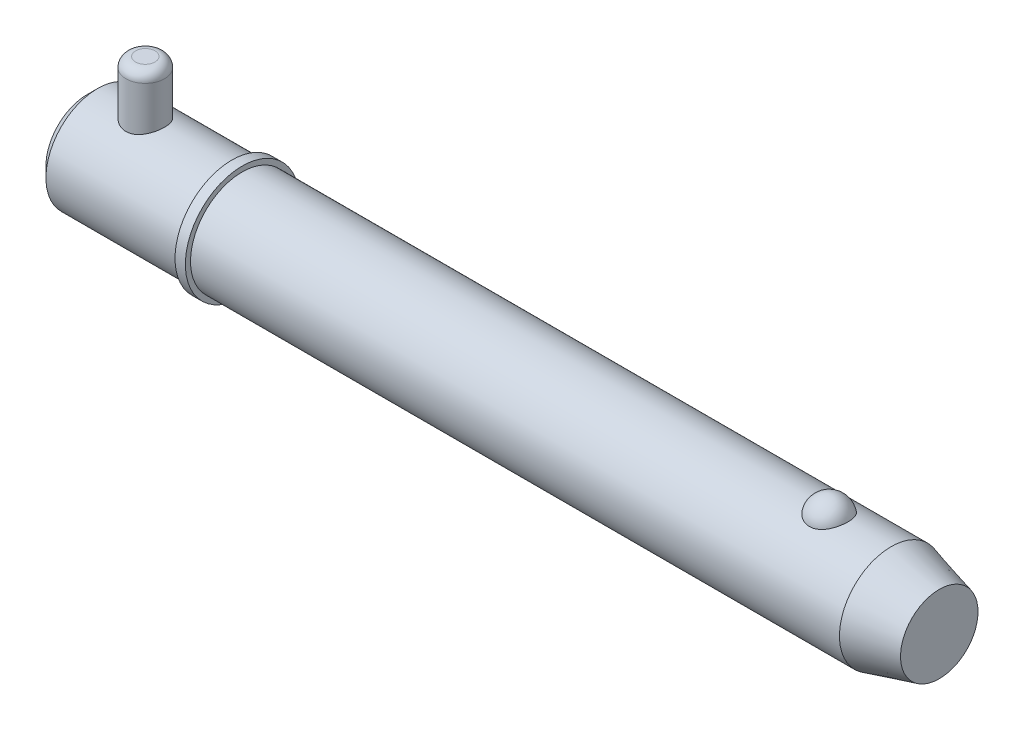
ISO-10303-21;
HEADER;
FILE_DESCRIPTION(('STEP AP214'),'2;1');
FILE_NAME('part.step','',(''),(''),'','','');
FILE_SCHEMA(('AUTOMOTIVE_DESIGN { 1 0 10303 214 1 1 1 1 }'));
ENDSEC;
DATA;
#1=APPLICATION_CONTEXT('core data for automotive mechanical design processes');
#2=APPLICATION_PROTOCOL_DEFINITION('international standard','automotive_design',2000,#1);
#3=PRODUCT_CONTEXT('',#1,'mechanical');
#4=PRODUCT('Part','Part','',(#3));
#5=PRODUCT_RELATED_PRODUCT_CATEGORY('part','',(#4));
#6=PRODUCT_DEFINITION_FORMATION('','',#4);
#7=PRODUCT_DEFINITION_CONTEXT('part definition',#1,'design');
#8=PRODUCT_DEFINITION('design','',#6,#7);
#9=PRODUCT_DEFINITION_SHAPE('','',#8);
#10=(LENGTH_UNIT() NAMED_UNIT(*) SI_UNIT(.MILLI.,.METRE.));
#11=(NAMED_UNIT(*) PLANE_ANGLE_UNIT() SI_UNIT($,.RADIAN.));
#12=(NAMED_UNIT(*) SI_UNIT($,.STERADIAN.) SOLID_ANGLE_UNIT());
#13=UNCERTAINTY_MEASURE_WITH_UNIT(LENGTH_MEASURE(1.E-05),#10,'distance_accuracy_value','');
#14=(GEOMETRIC_REPRESENTATION_CONTEXT(3) GLOBAL_UNCERTAINTY_ASSIGNED_CONTEXT((#13)) GLOBAL_UNIT_ASSIGNED_CONTEXT((#10,
#11,#12)) REPRESENTATION_CONTEXT('',''));
#15=CARTESIAN_POINT('',(0.,0.,0.));
#16=DIRECTION('',(0.,0.,1.));
#17=DIRECTION('',(1.,0.,0.));
#18=AXIS2_PLACEMENT_3D('',#15,#16,#17);
#19=CARTESIAN_POINT('',(14.28,25.4,0.));
#20=DIRECTION('',(0.,-1.,0.));
#21=DIRECTION('',(0.,0.,-1.));
#22=AXIS2_PLACEMENT_3D('',#19,#20,#21);
#23=CYLINDRICAL_SURFACE('',#22,4.76);
#24=CARTESIAN_POINT('',(14.28,-10.32,0.));
#25=DIRECTION('',(0.,1.,0.));
#26=DIRECTION('',(0.,0.,1.));
#27=AXIS2_PLACEMENT_3D('',#24,#25,#26);
#28=CIRCLE('',#27,4.76);
#29=CARTESIAN_POINT('',(14.28,-10.32,-4.76));
#30=VERTEX_POINT('',#29);
#31=EDGE_CURVE('P0_E25',#30,#30,#28,.T.);
#32=CARTESIAN_POINT('',(14.28,23.02,0.));
#33=DIRECTION('',(0.,1.,0.));
#34=DIRECTION('',(0.,0.,1.));
#35=AXIS2_PLACEMENT_3D('',#32,#33,#34);
#36=CIRCLE('',#35,4.76);
#37=CARTESIAN_POINT('',(14.28,23.02,-4.76));
#38=VERTEX_POINT('',#37);
#39=EDGE_CURVE('P0_E29',#38,#38,#36,.F.);
#40=CARTESIAN_POINT('',(14.28,-10.32,-4.76));
#41=CARTESIAN_POINT('',(14.28,-9.97270833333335,-4.76));
#42=CARTESIAN_POINT('',(14.28,-9.62541666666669,-4.76));
#43=CARTESIAN_POINT('',(14.28,-8.93083333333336,-4.76));
#44=CARTESIAN_POINT('',(14.28,-8.58354166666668,-4.76));
#45=CARTESIAN_POINT('',(14.28,-7.88895833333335,-4.76));
#46=CARTESIAN_POINT('',(14.28,-7.54166666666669,-4.76));
#47=CARTESIAN_POINT('',(14.28,-6.84708333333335,-4.76));
#48=CARTESIAN_POINT('',(14.28,-6.49979166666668,-4.76));
#49=CARTESIAN_POINT('',(14.28,-5.80520833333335,-4.76));
#50=CARTESIAN_POINT('',(14.28,-5.45791666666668,-4.76));
#51=CARTESIAN_POINT('',(14.28,-4.76333333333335,-4.76));
#52=CARTESIAN_POINT('',(14.28,-4.41604166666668,-4.76));
#53=CARTESIAN_POINT('',(14.28,-3.72145833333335,-4.76));
#54=CARTESIAN_POINT('',(14.28,-3.37416666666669,-4.76));
#55=CARTESIAN_POINT('',(14.28,-2.67958333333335,-4.76));
#56=CARTESIAN_POINT('',(14.28,-2.33229166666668,-4.76));
#57=CARTESIAN_POINT('',(14.28,-1.63770833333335,-4.76));
#58=CARTESIAN_POINT('',(14.28,-1.29041666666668,-4.76));
#59=CARTESIAN_POINT('',(14.28,-0.595833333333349,-4.76));
#60=CARTESIAN_POINT('',(14.28,-0.24854166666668,-4.76));
#61=CARTESIAN_POINT('',(14.28,0.446041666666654,-4.76));
#62=CARTESIAN_POINT('',(14.28,0.793333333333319,-4.76));
#63=CARTESIAN_POINT('',(14.28,1.48791666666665,-4.76));
#64=CARTESIAN_POINT('',(14.28,1.83520833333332,-4.76));
#65=CARTESIAN_POINT('',(14.28,2.52979166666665,-4.76));
#66=CARTESIAN_POINT('',(14.28,2.87708333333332,-4.76));
#67=CARTESIAN_POINT('',(14.28,3.57166666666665,-4.76));
#68=CARTESIAN_POINT('',(14.28,3.91895833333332,-4.76));
#69=CARTESIAN_POINT('',(14.28,4.61354166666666,-4.76));
#70=CARTESIAN_POINT('',(14.28,4.96083333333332,-4.76));
#71=CARTESIAN_POINT('',(14.28,5.65541666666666,-4.76));
#72=CARTESIAN_POINT('',(14.28,6.00270833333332,-4.76));
#73=CARTESIAN_POINT('',(14.28,6.69729166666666,-4.76));
#74=CARTESIAN_POINT('',(14.28,7.04458333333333,-4.76));
#75=CARTESIAN_POINT('',(14.28,7.73916666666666,-4.76));
#76=CARTESIAN_POINT('',(14.28,8.08645833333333,-4.76));
#77=CARTESIAN_POINT('',(14.28,8.78104166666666,-4.76));
#78=CARTESIAN_POINT('',(14.28,9.12833333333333,-4.76));
#79=CARTESIAN_POINT('',(14.28,9.82291666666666,-4.76));
#80=CARTESIAN_POINT('',(14.28,10.1702083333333,-4.76));
#81=CARTESIAN_POINT('',(14.28,10.8647916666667,-4.76));
#82=CARTESIAN_POINT('',(14.28,11.2120833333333,-4.76));
#83=CARTESIAN_POINT('',(14.28,11.9066666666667,-4.76));
#84=CARTESIAN_POINT('',(14.28,12.2539583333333,-4.76));
#85=CARTESIAN_POINT('',(14.28,12.9485416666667,-4.76));
#86=CARTESIAN_POINT('',(14.28,13.2958333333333,-4.76));
#87=CARTESIAN_POINT('',(14.28,13.9904166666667,-4.76));
#88=CARTESIAN_POINT('',(14.28,14.3377083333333,-4.76));
#89=CARTESIAN_POINT('',(14.28,15.0322916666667,-4.76));
#90=CARTESIAN_POINT('',(14.28,15.3795833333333,-4.76));
#91=CARTESIAN_POINT('',(14.28,16.0741666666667,-4.76));
#92=CARTESIAN_POINT('',(14.28,16.4214583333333,-4.76));
#93=CARTESIAN_POINT('',(14.28,17.1160416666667,-4.76));
#94=CARTESIAN_POINT('',(14.28,17.4633333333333,-4.76));
#95=CARTESIAN_POINT('',(14.28,18.1579166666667,-4.76));
#96=CARTESIAN_POINT('',(14.28,18.5052083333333,-4.76));
#97=CARTESIAN_POINT('',(14.28,19.1997916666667,-4.76));
#98=CARTESIAN_POINT('',(14.28,19.5470833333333,-4.76));
#99=CARTESIAN_POINT('',(14.28,20.2416666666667,-4.76));
#100=CARTESIAN_POINT('',(14.28,20.5889583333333,-4.76));
#101=CARTESIAN_POINT('',(14.28,21.2835416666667,-4.76));
#102=CARTESIAN_POINT('',(14.28,21.6308333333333,-4.76));
#103=CARTESIAN_POINT('',(14.28,22.3254166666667,-4.76));
#104=CARTESIAN_POINT('',(14.28,22.6727083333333,-4.76));
#105=CARTESIAN_POINT('',(14.28,23.02,-4.76));
#106=B_SPLINE_CURVE_WITH_KNOTS('',3,(#40,#41,#42,#43,#44,#45,#46,#47,#48,#49,#50,#51,#52,#53,
#54,#55,#56,#57,#58,#59,#60,#61,#62,#63,#64,#65,#66,#67,#68,#69,#70,#71,#72,#73,#74,#75,#76,#77,
#78,#79,#80,#81,#82,#83,#84,#85,#86,#87,#88,#89,#90,#91,#92,#93,#94,#95,#96,#97,#98,#99,#100,
#101,#102,#103,#104,#105),.UNSPECIFIED.,.F.,.F.,(4,2,2,2,2,2,2,2,2,2,2,2,2,2,2,2,2,2,2,2,2,2,2,
2,2,2,2,2,2,2,2,2,4),(0.,1.041875,2.08375,3.125625,4.1675,5.209375,6.25125,7.293125,
8.33500000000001,9.376875,10.41875,11.460625,12.5025,13.544375,14.58625,15.628125,16.67,
17.711875,18.75375,19.795625,20.8375,21.879375,22.92125,23.963125,25.005,26.046875,27.08875,
28.130625,29.1725,30.214375,31.25625,32.298125,33.34),.UNSPECIFIED.);
#107=EDGE_CURVE('P0_BSEAM14',#30,#38,#106,.T.);
#108=ORIENTED_EDGE('',*,*,#31,.T.);
#109=ORIENTED_EDGE('',*,*,#39,.T.);
#110=ORIENTED_EDGE('',*,*,#107,.T.);
#111=ORIENTED_EDGE('',*,*,#107,.F.);
#112=EDGE_LOOP('',(#108,#110,#109,#111));
#113=FACE_BOUND('',#112,.T.);
#114=ADVANCED_FACE('P0_F14',(#113),#23,.T.);
#115=CARTESIAN_POINT('',(14.28,25.4,0.));
#116=DIRECTION('',(0.,1.,0.));
#117=DIRECTION('',(0.,0.,1.));
#118=AXIS2_PLACEMENT_3D('',#115,#116,#117);
#119=PLANE('',#118);
#120=CARTESIAN_POINT('',(14.28,25.4,0.));
#121=DIRECTION('',(0.,1.,0.));
#122=DIRECTION('',(0.,0.,1.));
#123=AXIS2_PLACEMENT_3D('',#120,#121,#122);
#124=CIRCLE('',#123,2.38);
#125=CARTESIAN_POINT('',(14.28,25.4,2.38));
#126=VERTEX_POINT('',#125);
#127=EDGE_CURVE('P0_E10',#126,#126,#124,.T.);
#128=ORIENTED_EDGE('',*,*,#127,.T.);
#129=EDGE_LOOP('',(#128));
#130=FACE_BOUND('',#129,.T.);
#131=ADVANCED_FACE('P0_F46',(#130),#119,.T.);
#132=CARTESIAN_POINT('',(14.28,-12.7,0.));
#133=DIRECTION('',(0.,1.,0.));
#134=DIRECTION('',(0.,0.,1.));
#135=AXIS2_PLACEMENT_3D('',#132,#133,#134);
#136=PLANE('',#135);
#137=CARTESIAN_POINT('',(14.28,-12.7,0.));
#138=DIRECTION('',(0.,1.,0.));
#139=DIRECTION('',(0.,0.,1.));
#140=AXIS2_PLACEMENT_3D('',#137,#138,#139);
#141=CIRCLE('',#140,2.38);
#142=CARTESIAN_POINT('',(14.28,-12.7,2.38));
#143=VERTEX_POINT('',#142);
#144=EDGE_CURVE('P0_E21',#143,#143,#141,.F.);
#145=ORIENTED_EDGE('',*,*,#144,.T.);
#146=EDGE_LOOP('',(#145));
#147=FACE_BOUND('',#146,.T.);
#148=ADVANCED_FACE('P0_F43',(#147),#136,.F.);
#149=CARTESIAN_POINT('',(14.28,-10.32,0.));
#150=DIRECTION('',(0.,1.,0.));
#151=DIRECTION('',(0.,0.,1.));
#152=AXIS2_PLACEMENT_3D('',#149,#150,#151);
#153=DEGENERATE_TOROIDAL_SURFACE('',#152,2.38,2.38,.T.);
#154=ORIENTED_EDGE('',*,*,#144,.F.);
#155=EDGE_LOOP('',(#154));
#156=FACE_BOUND('',#155,.T.);
#157=ORIENTED_EDGE('',*,*,#31,.F.);
#158=EDGE_LOOP('',(#157));
#159=FACE_BOUND('',#158,.T.);
#160=ADVANCED_FACE('P0_F38',(#156,#159),#153,.T.);
#161=CARTESIAN_POINT('',(14.28,23.02,0.));
#162=DIRECTION('',(0.,1.,0.));
#163=DIRECTION('',(0.,0.,1.));
#164=AXIS2_PLACEMENT_3D('',#161,#162,#163);
#165=DEGENERATE_TOROIDAL_SURFACE('',#164,2.38,2.38,.T.);
#166=ORIENTED_EDGE('',*,*,#39,.F.);
#167=EDGE_LOOP('',(#166));
#168=FACE_BOUND('',#167,.T.);
#169=ORIENTED_EDGE('',*,*,#127,.F.);
#170=EDGE_LOOP('',(#169));
#171=FACE_BOUND('',#170,.T.);
#172=ADVANCED_FACE('P0_F16',(#168,#171),#165,.T.);
#173=CLOSED_SHELL('',(#114,#131,#148,#160,#172));
#174=MANIFOLD_SOLID_BREP('P0_B1',#173);
#175=CARTESIAN_POINT('',(0.,0.,0.));
#176=DIRECTION('',(1.,0.,0.));
#177=DIRECTION('',(0.,0.,-1.));
#178=AXIS2_PLACEMENT_3D('',#175,#176,#177);
#179=CYLINDRICAL_SURFACE('',#178,12.7);
#180=CARTESIAN_POINT('',(197.700738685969,0.,0.));
#181=DIRECTION('',(1.,0.,0.));
#182=DIRECTION('',(0.,0.,-1.));
#183=AXIS2_PLACEMENT_3D('',#180,#181,#182);
#184=CIRCLE('',#183,12.7);
#185=CARTESIAN_POINT('',(197.700738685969,0.,-12.7));
#186=VERTEX_POINT('',#185);
#187=EDGE_CURVE('P1_E81',#186,#186,#184,.T.);
#188=ORIENTED_EDGE('',*,*,#187,.F.);
#189=EDGE_LOOP('',(#188));
#190=FACE_BOUND('',#189,.T.);
#191=CARTESIAN_POINT('',(38.1,0.,0.));
#192=DIRECTION('',(1.,0.,0.));
#193=DIRECTION('',(0.,0.,-1.));
#194=AXIS2_PLACEMENT_3D('',#191,#192,#193);
#195=CIRCLE('',#194,12.7);
#196=CARTESIAN_POINT('',(38.1,0.,-12.7));
#197=VERTEX_POINT('',#196);
#198=EDGE_CURVE('P1_E85',#197,#197,#195,.T.);
#199=ORIENTED_EDGE('',*,*,#198,.T.);
#200=EDGE_LOOP('',(#199));
#201=FACE_BOUND('',#200,.T.);
#202=CARTESIAN_POINT('',(182.460042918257,11.7500437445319,4.81938502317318));
#203=CARTESIAN_POINT('',(182.335088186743,11.7500430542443,4.81938571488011));
#204=CARTESIAN_POINT('',(182.210144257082,11.7520975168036,4.81438658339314));
#205=CARTESIAN_POINT('',(181.961142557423,11.760253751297,4.79442904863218));
#206=CARTESIAN_POINT('',(181.837085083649,11.7663568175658,4.77946746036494));
#207=CARTESIAN_POINT('',(181.590901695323,11.7824262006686,4.73971414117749));
#208=CARTESIAN_POINT('',(181.468774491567,11.7923898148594,4.71492928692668));
#209=CARTESIAN_POINT('',(181.227187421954,11.8158938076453,4.65571340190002));
#210=CARTESIAN_POINT('',(181.10772859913,11.8294355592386,4.6212786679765));
#211=CARTESIAN_POINT('',(180.872557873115,11.8596812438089,4.54309502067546));
#212=CARTESIAN_POINT('',(180.756839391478,11.8763792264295,4.49936361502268));
#213=CARTESIAN_POINT('',(180.529653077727,11.9124878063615,4.40287235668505));
#214=CARTESIAN_POINT('',(180.418186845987,11.9318994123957,4.35010914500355));
#215=CARTESIAN_POINT('',(180.091278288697,11.9934256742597,4.17881316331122));
#216=CARTESIAN_POINT('',(179.883127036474,12.038858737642,4.04720756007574));
#217=CARTESIAN_POINT('',(179.485850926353,12.1352173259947,3.748564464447));
#218=CARTESIAN_POINT('',(179.297443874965,12.1862630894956,3.58061821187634));
#219=CARTESIAN_POINT('',(178.950521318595,12.2875163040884,3.21600758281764));
#220=CARTESIAN_POINT('',(178.792011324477,12.3377235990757,3.01933792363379));
#221=CARTESIAN_POINT('',(178.50168878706,12.4344923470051,2.592916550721));
#222=CARTESIAN_POINT('',(178.371376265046,12.4807925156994,2.36208286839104));
#223=CARTESIAN_POINT('',(178.149407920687,12.5623454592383,1.88070399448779));
#224=CARTESIAN_POINT('',(178.057755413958,12.5975972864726,1.63015711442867));
#225=CARTESIAN_POINT('',(177.914046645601,12.6538414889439,1.1129886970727));
#226=CARTESIAN_POINT('',(177.862499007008,12.6746503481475,0.846205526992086));
#227=CARTESIAN_POINT('',(177.801977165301,12.699153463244,0.307085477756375));
#228=CARTESIAN_POINT('',(177.793001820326,12.7028481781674,0.0347487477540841));
#229=CARTESIAN_POINT('',(177.817731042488,12.6927785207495,-0.506073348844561));
#230=CARTESIAN_POINT('',(177.851189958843,12.6791146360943,-0.774571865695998));
#231=CARTESIAN_POINT('',(177.959687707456,12.635882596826,-1.30170246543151));
#232=CARTESIAN_POINT('',(178.03472729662,12.606314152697,-1.56033436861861));
#233=CARTESIAN_POINT('',(178.22500006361,12.5342328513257,-2.06083899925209));
#234=CARTESIAN_POINT('',(178.340287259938,12.4917026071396,-2.30268867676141));
#235=CARTESIAN_POINT('',(178.608704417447,12.3981123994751,-2.76259600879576));
#236=CARTESIAN_POINT('',(178.761837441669,12.3470517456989,-2.98065173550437));
#237=CARTESIAN_POINT('',(179.103507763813,12.2416045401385,-3.38786328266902));
#238=CARTESIAN_POINT('',(179.292201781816,12.1872040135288,-3.57688418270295));
#239=CARTESIAN_POINT('',(179.700239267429,12.0814086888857,-3.91941073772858));
#240=CARTESIAN_POINT('',(179.919580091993,12.0300136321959,-4.07291945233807));
#241=CARTESIAN_POINT('',(180.378375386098,11.9373542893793,-4.33691289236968));
#242=CARTESIAN_POINT('',(180.617304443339,11.8958982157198,-4.44824125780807));
#243=CARTESIAN_POINT('',(181.11243761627,11.8268116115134,-4.62881985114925));
#244=CARTESIAN_POINT('',(181.368635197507,11.7991758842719,-4.69808589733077));
#245=CARTESIAN_POINT('',(181.877164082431,11.7622209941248,-4.78983181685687));
#246=CARTESIAN_POINT('',(182.129041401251,11.7520502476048,-4.81449025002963));
#247=CARTESIAN_POINT('',(182.633573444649,11.7485796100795,-4.82295735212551));
#248=CARTESIAN_POINT('',(182.886228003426,11.7552763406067,-4.80677420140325));
#249=CARTESIAN_POINT('',(183.376834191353,11.7842584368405,-4.73525430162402));
#250=CARTESIAN_POINT('',(183.614998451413,11.8060486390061,-4.68116061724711));
#251=CARTESIAN_POINT('',(184.078489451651,11.8622750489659,-4.53678133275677));
#252=CARTESIAN_POINT('',(184.303815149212,11.8967122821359,-4.44649279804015));
#253=CARTESIAN_POINT('',(184.740801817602,11.9754603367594,-4.22987613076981));
#254=CARTESIAN_POINT('',(184.952057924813,12.0199699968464,-4.10280539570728));
#255=CARTESIAN_POINT('',(185.350601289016,12.1138028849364,-3.81685409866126));
#256=CARTESIAN_POINT('',(185.537883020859,12.163127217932,-3.65796622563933));
#257=CARTESIAN_POINT('',(185.893350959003,12.2642343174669,-3.30364864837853));
#258=CARTESIAN_POINT('',(186.060111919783,12.3160165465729,-3.10678783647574));
#259=CARTESIAN_POINT('',(186.359579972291,12.4142566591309,-2.68748409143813));
#260=CARTESIAN_POINT('',(186.492280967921,12.4607135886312,-2.46503658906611));
#261=CARTESIAN_POINT('',(186.724691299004,12.5450236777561,-1.9928951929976));
#262=CARTESIAN_POINT('',(186.823215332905,12.5825557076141,-1.74255918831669));
#263=CARTESIAN_POINT('',(186.979227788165,12.6431720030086,-1.22773734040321));
#264=CARTESIAN_POINT('',(187.036715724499,12.6662560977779,-0.963251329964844));
#265=CARTESIAN_POINT('',(187.109544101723,12.6956486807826,-0.427355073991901));
#266=CARTESIAN_POINT('',(187.124837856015,12.7019385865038,-0.155937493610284));
#267=CARTESIAN_POINT('',(187.112779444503,12.6970201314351,0.385928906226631));
#268=CARTESIAN_POINT('',(187.08542805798,12.6858120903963,0.656377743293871));
#269=CARTESIAN_POINT('',(187.013060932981,12.6568455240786,1.05454017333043));
#270=CARTESIAN_POINT('',(186.983796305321,12.6451962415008,1.185778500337));
#271=CARTESIAN_POINT('',(186.915022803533,12.6181819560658,1.44513808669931));
#272=CARTESIAN_POINT('',(186.875517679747,12.6028183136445,1.57326046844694));
#273=CARTESIAN_POINT('',(186.786439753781,12.568754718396,1.82554978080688));
#274=CARTESIAN_POINT('',(186.736862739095,12.5500533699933,1.94971503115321));
#275=CARTESIAN_POINT('',(186.62792115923,12.5098093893,2.19314370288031));
#276=CARTESIAN_POINT('',(186.568560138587,12.4882677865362,2.31240887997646));
#277=CARTESIAN_POINT('',(186.43997128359,12.4427679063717,2.54593031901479));
#278=CARTESIAN_POINT('',(186.370688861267,12.4187964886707,2.66015396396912));
#279=CARTESIAN_POINT('',(186.222903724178,12.3691892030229,2.88202659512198));
#280=CARTESIAN_POINT('',(186.144404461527,12.3435539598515,2.98967802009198));
#281=CARTESIAN_POINT('',(185.978550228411,12.2912955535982,3.19774385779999));
#282=CARTESIAN_POINT('',(185.891191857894,12.2646720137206,3.298155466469));
#283=CARTESIAN_POINT('',(185.708161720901,12.2111945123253,3.49095035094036));
#284=CARTESIAN_POINT('',(185.612493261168,12.1843406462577,3.58333679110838));
#285=CARTESIAN_POINT('',(185.413627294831,12.1312249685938,3.75922876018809));
#286=CARTESIAN_POINT('',(185.310450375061,12.104961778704,3.84275713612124));
#287=CARTESIAN_POINT('',(185.09701336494,12.0537284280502,4.00056406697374));
#288=CARTESIAN_POINT('',(184.986756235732,12.028757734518,4.07484645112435));
#289=CARTESIAN_POINT('',(184.759755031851,11.9808306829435,4.21367959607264));
#290=CARTESIAN_POINT('',(184.643006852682,11.9578756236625,4.27822410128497));
#291=CARTESIAN_POINT('',(184.40394258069,11.9147184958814,4.39698483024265));
#292=CARTESIAN_POINT('',(184.281628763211,11.894515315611,4.45120522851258));
#293=CARTESIAN_POINT('',(184.022952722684,11.8561129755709,4.55255353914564));
#294=CARTESIAN_POINT('',(183.886223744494,11.8381764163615,4.59884858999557));
#295=CARTESIAN_POINT('',(183.608608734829,11.8069093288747,4.67853897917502));
#296=CARTESIAN_POINT('',(183.467724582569,11.7935767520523,4.71194005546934));
#297=CARTESIAN_POINT('',(183.18309446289,11.7720277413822,4.76552188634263));
#298=CARTESIAN_POINT('',(183.039348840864,11.7638106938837,4.78570422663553));
#299=CARTESIAN_POINT('',(182.750411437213,11.7528195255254,4.81263433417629));
#300=CARTESIAN_POINT('',(182.605219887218,11.7500445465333,4.81938421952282));
#301=CARTESIAN_POINT('',(182.460042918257,11.7500437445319,4.81938502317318));
#302=B_SPLINE_CURVE_WITH_KNOTS('',3,(#202,#203,#204,#205,#206,#207,#208,#209,#210,#211,#212,
#213,#214,#215,#216,#217,#218,#219,#220,#221,#222,#223,#224,#225,#226,#227,#228,#229,#230,#231,
#232,#233,#234,#235,#236,#237,#238,#239,#240,#241,#242,#243,#244,#245,#246,#247,#248,#249,#250,
#251,#252,#253,#254,#255,#256,#257,#258,#259,#260,#261,#262,#263,#264,#265,#266,#267,#268,#269,
#270,#271,#272,#273,#274,#275,#276,#277,#278,#279,#280,#281,#282,#283,#284,#285,#286,#287,#288,
#289,#290,#291,#292,#293,#294,#295,#296,#297,#298,#299,#300,#301),.UNSPECIFIED.,.T.,.F.,(4,2,2,
2,2,2,2,2,2,2,2,2,2,2,2,2,2,2,2,2,2,2,2,2,2,2,2,2,2,2,2,2,2,2,2,2,2,2,2,2,2,2,2,2,2,2,2,2,2,4),
(0.,0.374729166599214,0.749578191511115,1.12416526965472,1.49889629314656,1.87292776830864,
2.24709865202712,2.99481328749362,3.76399449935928,4.53331735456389,5.3368391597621,
6.14042986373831,6.95405296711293,7.76765424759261,8.57656703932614,9.38549455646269,
10.1955119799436,11.0055949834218,11.8193353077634,12.6330054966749,13.4294141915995,
14.2255231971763,14.9815786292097,15.7374826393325,16.4696948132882,17.2019663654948,
17.9501979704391,18.6986017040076,19.484470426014,20.2704797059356,21.0815215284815,
21.8925729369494,22.7045213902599,23.5164550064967,23.9209608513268,24.3253187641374,
24.7298461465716,25.1342272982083,25.54092555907,25.9474719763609,26.3541750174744,
26.7607169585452,27.1661834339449,27.5714814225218,27.9770386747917,28.3824315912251,
28.8181206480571,29.2536155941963,29.6890582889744,30.1244323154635),.UNSPECIFIED.);
#303=CARTESIAN_POINT('',(182.460042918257,11.7500437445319,4.81938502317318));
#304=VERTEX_POINT('',#303);
#305=EDGE_CURVE('P1_E35',#304,#304,#302,.T.);
#306=ORIENTED_EDGE('',*,*,#305,.T.);
#307=EDGE_LOOP('',(#306));
#308=FACE_BOUND('',#307,.T.);
#309=ADVANCED_FACE('P1_F13',(#190,#201,#308),#179,.T.);
#310=CARTESIAN_POINT('',(0.,0.,0.));
#311=DIRECTION('',(-1.,0.,0.));
#312=DIRECTION('',(0.,0.,1.));
#313=AXIS2_PLACEMENT_3D('',#310,#311,#312);
#314=PLANE('',#313);
#315=CARTESIAN_POINT('',(0.,0.,0.));
#316=DIRECTION('',(1.,0.,0.));
#317=DIRECTION('',(0.,0.,-1.));
#318=AXIS2_PLACEMENT_3D('',#315,#316,#317);
#319=CIRCLE('',#318,10.16);
#320=CARTESIAN_POINT('',(0.,0.,-10.16));
#321=VERTEX_POINT('',#320);
#322=EDGE_CURVE('P1_E9',#321,#321,#319,.T.);
#323=ORIENTED_EDGE('',*,*,#322,.F.);
#324=EDGE_LOOP('',(#323));
#325=FACE_BOUND('',#324,.T.);
#326=ADVANCED_FACE('P1_F15',(#325),#314,.T.);
#327=CARTESIAN_POINT('',(2.53999999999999,0.,0.));
#328=DIRECTION('',(1.,0.,0.));
#329=DIRECTION('',(0.,0.,-1.));
#330=AXIS2_PLACEMENT_3D('',#327,#328,#329);
#331=CONICAL_SURFACE('',#330,12.7,0.78539816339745);
#332=ORIENTED_EDGE('',*,*,#322,.T.);
#333=EDGE_LOOP('',(#332));
#334=FACE_BOUND('',#333,.T.);
#335=CARTESIAN_POINT('',(2.53999999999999,0.,0.));
#336=DIRECTION('',(1.,0.,0.));
#337=DIRECTION('',(0.,0.,-1.));
#338=AXIS2_PLACEMENT_3D('',#335,#336,#337);
#339=CIRCLE('',#338,12.7);
#340=CARTESIAN_POINT('',(2.53999999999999,0.,-12.7));
#341=VERTEX_POINT('',#340);
#342=EDGE_CURVE('P1_E26',#341,#341,#339,.T.);
#343=ORIENTED_EDGE('',*,*,#342,.F.);
#344=EDGE_LOOP('',(#343));
#345=FACE_BOUND('',#344,.T.);
#346=ADVANCED_FACE('P1_F77',(#334,#345),#331,.T.);
#347=CARTESIAN_POINT('',(0.,0.,0.));
#348=DIRECTION('',(1.,0.,0.));
#349=DIRECTION('',(0.,0.,-1.));
#350=AXIS2_PLACEMENT_3D('',#347,#348,#349);
#351=CYLINDRICAL_SURFACE('',#350,12.7);
#352=CARTESIAN_POINT('',(14.28,-11.7742260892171,4.76));
#353=CARTESIAN_POINT('',(14.1514948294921,-11.7742255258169,4.76000061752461));
#354=CARTESIAN_POINT('',(14.0229980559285,-11.7763355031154,4.75479194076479));
#355=CARTESIAN_POINT('',(13.7669369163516,-11.7847043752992,4.73401198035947));
#356=CARTESIAN_POINT('',(13.6393728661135,-11.7909646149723,4.71843733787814));
#357=CARTESIAN_POINT('',(13.386226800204,-11.8074248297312,4.67709434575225));
#358=CARTESIAN_POINT('',(13.2606439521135,-11.8176231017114,4.65133040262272));
#359=CARTESIAN_POINT('',(13.0122434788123,-11.8416347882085,4.58985545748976));
#360=CARTESIAN_POINT('',(12.8894269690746,-11.8554496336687,4.55414051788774));
#361=CARTESIAN_POINT('',(12.6477622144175,-11.8862222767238,4.47320764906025));
#362=CARTESIAN_POINT('',(12.5289037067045,-11.9031710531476,4.4280169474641));
#363=CARTESIAN_POINT('',(12.2955059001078,-11.939736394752,4.32845291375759));
#364=CARTESIAN_POINT('',(12.1809682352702,-11.9593539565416,4.2740761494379));
#365=CARTESIAN_POINT('',(11.8448901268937,-12.0213893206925,4.09777237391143));
#366=CARTESIAN_POINT('',(11.6307077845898,-12.0670135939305,3.9626122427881));
#367=CARTESIAN_POINT('',(11.2179129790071,-12.1641514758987,3.65386230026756));
#368=CARTESIAN_POINT('',(11.0204399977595,-12.2158379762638,3.47881300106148));
#369=CARTESIAN_POINT('',(10.6568212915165,-12.3178468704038,3.09829182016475));
#370=CARTESIAN_POINT('',(10.4906822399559,-12.3681689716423,2.89281347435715));
#371=CARTESIAN_POINT('',(10.1890299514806,-12.4638367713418,2.44867909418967));
#372=CARTESIAN_POINT('',(10.054749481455,-12.5089552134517,2.20913281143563));
#373=CARTESIAN_POINT('',(9.82886079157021,-12.5870472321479,1.70885919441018));
#374=CARTESIAN_POINT('',(9.73723778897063,-12.620025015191,1.44813923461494));
#375=CARTESIAN_POINT('',(9.60324488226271,-12.6688874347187,0.9248423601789));
#376=CARTESIAN_POINT('',(9.55892269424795,-12.6854474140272,0.662829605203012));
#377=CARTESIAN_POINT('',(9.5145335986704,-12.7020320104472,0.134596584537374));
#378=CARTESIAN_POINT('',(9.5144523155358,-12.7020619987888,-0.131622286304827));
#379=CARTESIAN_POINT('',(9.55741019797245,-12.6860129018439,-0.646717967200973));
#380=CARTESIAN_POINT('',(9.59831845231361,-12.6707298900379,-0.895801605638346));
#381=CARTESIAN_POINT('',(9.71850987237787,-12.6268158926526,-1.38327219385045));
#382=CARTESIAN_POINT('',(9.79779575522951,-12.5981839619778,-1.62165838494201));
#383=CARTESIAN_POINT('',(9.99348296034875,-12.5298894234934,-2.08508424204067));
#384=CARTESIAN_POINT('',(10.110407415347,-12.4900724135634,-2.30987931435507));
#385=CARTESIAN_POINT('',(10.3775896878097,-12.4034373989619,-2.7372158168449));
#386=CARTESIAN_POINT('',(10.5278582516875,-12.3566171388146,-2.93975004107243));
#387=CARTESIAN_POINT('',(10.8677318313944,-12.257571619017,-3.32936830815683));
#388=CARTESIAN_POINT('',(11.0591227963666,-12.2051903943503,-3.51485714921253));
#389=CARTESIAN_POINT('',(11.4706087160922,-12.1031155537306,-3.85170663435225));
#390=CARTESIAN_POINT('',(11.6907108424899,-12.0534226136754,-4.00305872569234));
#391=CARTESIAN_POINT('',(12.1596597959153,-11.9613684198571,-4.27038218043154));
#392=CARTESIAN_POINT('',(12.4090353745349,-11.9191939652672,-4.38549550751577));
#393=CARTESIAN_POINT('',(12.9256290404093,-11.8491124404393,-4.57149117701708));
#394=CARTESIAN_POINT('',(13.1928371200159,-11.8211974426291,-4.64239810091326));
#395=CARTESIAN_POINT('',(13.7217488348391,-11.7846654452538,-4.73434137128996));
#396=CARTESIAN_POINT('',(13.9829438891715,-11.7750694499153,-4.75791141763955));
#397=CARTESIAN_POINT('',(14.5056760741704,-11.7734909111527,-4.76182097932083));
#398=CARTESIAN_POINT('',(14.7672131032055,-11.7815039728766,-4.74217128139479));
#399=CARTESIAN_POINT('',(15.2702140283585,-11.8132466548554,-4.66249544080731));
#400=CARTESIAN_POINT('',(15.5120417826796,-11.8362133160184,-4.60442726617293));
#401=CARTESIAN_POINT('',(15.9824097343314,-11.8943704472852,-4.45202868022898));
#402=CARTESIAN_POINT('',(16.2109472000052,-11.9295634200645,-4.35769084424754));
#403=CARTESIAN_POINT('',(16.6577741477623,-12.0098310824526,-4.13144368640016));
#404=CARTESIAN_POINT('',(16.8753590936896,-12.055226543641,-3.99825937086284));
#405=CARTESIAN_POINT('',(17.2859732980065,-12.150238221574,-3.69949845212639));
#406=CARTESIAN_POINT('',(17.4789935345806,-12.19985597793,-3.5339100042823));
#407=CARTESIAN_POINT('',(17.8477707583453,-12.3015434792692,-3.1624728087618));
#408=CARTESIAN_POINT('',(18.0216609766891,-12.3535695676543,-2.95473880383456));
#409=CARTESIAN_POINT('',(18.254545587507,-12.426745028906,-2.62277433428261));
#410=CARTESIAN_POINT('',(18.3275489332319,-12.4503382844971,-2.50865480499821));
#411=CARTESIAN_POINT('',(18.463723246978,-12.4952713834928,-2.27428971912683));
#412=CARTESIAN_POINT('',(18.5268984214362,-12.5166121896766,-2.15404681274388));
#413=CARTESIAN_POINT('',(18.6427140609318,-12.5563817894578,-1.90858448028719));
#414=CARTESIAN_POINT('',(18.6953855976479,-12.5748191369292,-1.78338108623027));
#415=CARTESIAN_POINT('',(18.7899337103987,-12.6083284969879,-1.52857834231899));
#416=CARTESIAN_POINT('',(18.8318147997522,-12.6234019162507,-1.39898085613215));
#417=CARTESIAN_POINT('',(18.9043819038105,-12.6497495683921,-1.13633254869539));
#418=CARTESIAN_POINT('',(18.9350698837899,-12.6610244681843,-1.00328233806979));
#419=CARTESIAN_POINT('',(18.9849303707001,-12.6794412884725,-0.734761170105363));
#420=CARTESIAN_POINT('',(19.0041035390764,-12.6865834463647,-0.59929035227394));
#421=CARTESIAN_POINT('',(19.0299427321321,-12.6962286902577,-0.335006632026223));
#422=CARTESIAN_POINT('',(19.0372742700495,-12.698978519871,-0.206267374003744));
#423=CARTESIAN_POINT('',(19.0414668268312,-12.7005496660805,0.0514515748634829));
#424=CARTESIAN_POINT('',(19.038324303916,-12.69936965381,0.180431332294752));
#425=CARTESIAN_POINT('',(19.0215965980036,-12.6931114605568,0.437551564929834));
#426=CARTESIAN_POINT('',(19.0080165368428,-12.6880351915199,0.565692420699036));
#427=CARTESIAN_POINT('',(18.9705519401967,-12.6741222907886,0.820297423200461));
#428=CARTESIAN_POINT('',(18.9466635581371,-12.665284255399,0.946760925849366));
#429=CARTESIAN_POINT('',(18.8895279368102,-12.6443449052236,1.19395899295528));
#430=CARTESIAN_POINT('',(18.8565273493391,-12.6323299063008,1.3147578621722));
#431=CARTESIAN_POINT('',(18.781239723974,-12.6052503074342,1.55308888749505));
#432=CARTESIAN_POINT('',(18.738949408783,-12.5901846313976,1.67061987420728));
#433=CARTESIAN_POINT('',(18.5986461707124,-12.5409473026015,2.01714406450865));
#434=CARTESIAN_POINT('',(18.4871532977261,-12.502717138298,2.24027279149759));
#435=CARTESIAN_POINT('',(18.2262440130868,-12.4173042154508,2.6742599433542));
#436=CARTESIAN_POINT('',(18.0754310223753,-12.3698127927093,2.88420891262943));
#437=CARTESIAN_POINT('',(17.7421836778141,-12.271667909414,3.27675114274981));
#438=CARTESIAN_POINT('',(17.5597380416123,-12.2210133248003,3.45933459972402));
#439=CARTESIAN_POINT('',(17.2605468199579,-12.1452079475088,3.7138066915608));
#440=CARTESIAN_POINT('',(17.1535518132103,-12.119328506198,3.79719993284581));
#441=CARTESIAN_POINT('',(16.9326449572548,-12.0688597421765,3.95467398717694));
#442=CARTESIAN_POINT('',(16.8187356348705,-12.0442699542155,4.02875817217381));
#443=CARTESIAN_POINT('',(16.5846234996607,-11.9971053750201,4.16711104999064));
#444=CARTESIAN_POINT('',(16.4644172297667,-11.9745317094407,4.23137427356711));
#445=CARTESIAN_POINT('',(16.2185866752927,-11.9321360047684,4.34949041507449));
#446=CARTESIAN_POINT('',(16.09296473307,-11.9123127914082,4.40334777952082));
#447=CARTESIAN_POINT('',(15.8314769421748,-11.875268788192,4.50232278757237));
#448=CARTESIAN_POINT('',(15.6954035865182,-11.8582009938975,4.54695127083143));
#449=CARTESIAN_POINT('',(15.4194002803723,-11.8284328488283,4.62383807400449));
#450=CARTESIAN_POINT('',(15.2794720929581,-11.815730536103,4.6561019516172));
#451=CARTESIAN_POINT('',(14.9969657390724,-11.7951940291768,4.70788444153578));
#452=CARTESIAN_POINT('',(14.8543884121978,-11.7873583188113,4.72740702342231));
#453=CARTESIAN_POINT('',(14.5678704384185,-11.7768749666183,4.75346370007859));
#454=CARTESIAN_POINT('',(14.4239299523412,-11.7742267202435,4.75999930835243));
#455=CARTESIAN_POINT('',(14.28,-11.7742260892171,4.76));
#456=B_SPLINE_CURVE_WITH_KNOTS('',3,(#352,#353,#354,#355,#356,#357,#358,#359,#360,#361,#362,
#363,#364,#365,#366,#367,#368,#369,#370,#371,#372,#373,#374,#375,#376,#377,#378,#379,#380,#381,
#382,#383,#384,#385,#386,#387,#388,#389,#390,#391,#392,#393,#394,#395,#396,#397,#398,#399,#400,
#401,#402,#403,#404,#405,#406,#407,#408,#409,#410,#411,#412,#413,#414,#415,#416,#417,#418,#419,
#420,#421,#422,#423,#424,#425,#426,#427,#428,#429,#430,#431,#432,#433,#434,#435,#436,#437,#438,
#439,#440,#441,#442,#443,#444,#445,#446,#447,#448,#449,#450,#451,#452,#453,#454,#455),
.UNSPECIFIED.,.T.,.F.,(4,2,2,2,2,2,2,2,2,2,2,2,2,2,2,2,2,2,2,2,2,2,2,2,2,2,2,2,2,2,2,2,2,2,2,2,
2,2,2,2,2,2,2,2,2,2,2,2,2,2,2,4),(0.,0.385378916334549,0.770882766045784,1.15622008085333,
1.54171009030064,1.92610725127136,2.31064835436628,3.07917291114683,3.88239385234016,
4.68578566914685,5.51648193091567,6.34689010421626,7.14151420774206,7.93588010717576,
8.69098665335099,9.44614666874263,10.2122918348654,10.9786842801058,11.789876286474,
12.6012713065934,13.4306405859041,14.2595482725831,15.0427613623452,15.8257790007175,
16.5716820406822,17.3177378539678,18.0917395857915,18.8660247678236,19.6893332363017,
20.1014571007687,20.5134040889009,20.9241137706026,21.3346513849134,21.7451168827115,
22.1555587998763,22.542011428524,22.928594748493,23.3149884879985,23.7015265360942,
24.0784835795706,24.4555738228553,25.2091300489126,25.994347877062,26.7798463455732,
27.1937428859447,27.6074890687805,28.0214648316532,28.4352633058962,28.8672794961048,
29.299101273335,29.7307884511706,30.1624253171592),.UNSPECIFIED.);
#457=CARTESIAN_POINT('',(14.28,-11.7742260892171,4.76));
#458=VERTEX_POINT('',#457);
#459=EDGE_CURVE('P1_E17',#458,#458,#456,.T.);
#460=ORIENTED_EDGE('',*,*,#459,.F.);
#461=EDGE_LOOP('',(#460));
#462=FACE_BOUND('',#461,.T.);
#463=CARTESIAN_POINT('',(14.28,11.7742260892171,4.76));
#464=CARTESIAN_POINT('',(14.4085051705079,11.7742255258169,4.76000061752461));
#465=CARTESIAN_POINT('',(14.5370019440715,11.7763355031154,4.75479194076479));
#466=CARTESIAN_POINT('',(14.7930630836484,11.7847043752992,4.73401198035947));
#467=CARTESIAN_POINT('',(14.9206271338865,11.7909646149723,4.71843733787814));
#468=CARTESIAN_POINT('',(15.173773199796,11.8074248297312,4.67709434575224));
#469=CARTESIAN_POINT('',(15.2993560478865,11.8176231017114,4.65133040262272));
#470=CARTESIAN_POINT('',(15.5477565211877,11.8416347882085,4.58985545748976));
#471=CARTESIAN_POINT('',(15.6705730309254,11.8554496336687,4.55414051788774));
#472=CARTESIAN_POINT('',(15.9122377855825,11.8862222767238,4.47320764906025));
#473=CARTESIAN_POINT('',(16.0310962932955,11.9031710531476,4.4280169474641));
#474=CARTESIAN_POINT('',(16.2644940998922,11.939736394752,4.32845291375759));
#475=CARTESIAN_POINT('',(16.3790317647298,11.9593539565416,4.2740761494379));
#476=CARTESIAN_POINT('',(16.7151098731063,12.0213893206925,4.09777237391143));
#477=CARTESIAN_POINT('',(16.9292922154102,12.0670135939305,3.96261224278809));
#478=CARTESIAN_POINT('',(17.3420870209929,12.1641514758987,3.65386230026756));
#479=CARTESIAN_POINT('',(17.5395600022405,12.2158379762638,3.47881300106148));
#480=CARTESIAN_POINT('',(17.9031787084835,12.3178468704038,3.09829182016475));
#481=CARTESIAN_POINT('',(18.0693177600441,12.3681689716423,2.89281347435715));
#482=CARTESIAN_POINT('',(18.3709700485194,12.4638367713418,2.44867909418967));
#483=CARTESIAN_POINT('',(18.505250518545,12.5089552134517,2.20913281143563));
#484=CARTESIAN_POINT('',(18.7311392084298,12.5870472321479,1.70885919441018));
#485=CARTESIAN_POINT('',(18.8227622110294,12.620025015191,1.44813923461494));
#486=CARTESIAN_POINT('',(18.9567551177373,12.6688874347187,0.924842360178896));
#487=CARTESIAN_POINT('',(19.0010773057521,12.6854474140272,0.662829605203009));
#488=CARTESIAN_POINT('',(19.0454664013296,12.7020320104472,0.134596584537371));
#489=CARTESIAN_POINT('',(19.0455476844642,12.7020619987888,-0.13162228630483));
#490=CARTESIAN_POINT('',(19.0025898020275,12.6860129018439,-0.646717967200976));
#491=CARTESIAN_POINT('',(18.9616815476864,12.6707298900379,-0.89580160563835));
#492=CARTESIAN_POINT('',(18.8414901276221,12.6268158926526,-1.38327219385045));
#493=CARTESIAN_POINT('',(18.7622042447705,12.5981839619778,-1.62165838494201));
#494=CARTESIAN_POINT('',(18.5665170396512,12.5298894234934,-2.08508424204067));
#495=CARTESIAN_POINT('',(18.449592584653,12.4900724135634,-2.30987931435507));
#496=CARTESIAN_POINT('',(18.1824103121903,12.4034373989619,-2.7372158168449));
#497=CARTESIAN_POINT('',(18.0321417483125,12.3566171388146,-2.93975004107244));
#498=CARTESIAN_POINT('',(17.6922681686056,12.257571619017,-3.32936830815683));
#499=CARTESIAN_POINT('',(17.5008772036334,12.2051903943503,-3.51485714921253));
#500=CARTESIAN_POINT('',(17.0893912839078,12.1031155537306,-3.85170663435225));
#501=CARTESIAN_POINT('',(16.8692891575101,12.0534226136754,-4.00305872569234));
#502=CARTESIAN_POINT('',(16.4003402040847,11.9613684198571,-4.27038218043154));
#503=CARTESIAN_POINT('',(16.1509646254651,11.9191939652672,-4.38549550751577));
#504=CARTESIAN_POINT('',(15.6343709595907,11.8491124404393,-4.57149117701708));
#505=CARTESIAN_POINT('',(15.367162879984,11.8211974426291,-4.64239810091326));
#506=CARTESIAN_POINT('',(14.8382511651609,11.7846654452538,-4.73434137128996));
#507=CARTESIAN_POINT('',(14.5770561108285,11.7750694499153,-4.75791141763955));
#508=CARTESIAN_POINT('',(14.0543239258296,11.7734909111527,-4.76182097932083));
#509=CARTESIAN_POINT('',(13.7927868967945,11.7815039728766,-4.74217128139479));
#510=CARTESIAN_POINT('',(13.2897859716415,11.8132466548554,-4.66249544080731));
#511=CARTESIAN_POINT('',(13.0479582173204,11.8362133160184,-4.60442726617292));
#512=CARTESIAN_POINT('',(12.5775902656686,11.8943704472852,-4.45202868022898));
#513=CARTESIAN_POINT('',(12.3490527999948,11.9295634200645,-4.35769084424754));
#514=CARTESIAN_POINT('',(11.9022258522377,12.0098310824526,-4.13144368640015));
#515=CARTESIAN_POINT('',(11.6846409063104,12.055226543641,-3.99825937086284));
#516=CARTESIAN_POINT('',(11.2740267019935,12.150238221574,-3.69949845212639));
#517=CARTESIAN_POINT('',(11.0810064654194,12.19985597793,-3.5339100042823));
#518=CARTESIAN_POINT('',(10.7122292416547,12.3015434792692,-3.1624728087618));
#519=CARTESIAN_POINT('',(10.5383390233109,12.3535695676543,-2.95473880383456));
#520=CARTESIAN_POINT('',(10.305454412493,12.426745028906,-2.6227743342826));
#521=CARTESIAN_POINT('',(10.2324510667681,12.4503382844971,-2.50865480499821));
#522=CARTESIAN_POINT('',(10.096276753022,12.4952713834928,-2.27428971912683));
#523=CARTESIAN_POINT('',(10.0331015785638,12.5166121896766,-2.15404681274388));
#524=CARTESIAN_POINT('',(9.91728593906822,12.5563817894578,-1.90858448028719));
#525=CARTESIAN_POINT('',(9.8646144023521,12.5748191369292,-1.78338108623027));
#526=CARTESIAN_POINT('',(9.77006628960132,12.6083284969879,-1.52857834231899));
#527=CARTESIAN_POINT('',(9.72818520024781,12.6234019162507,-1.39898085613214));
#528=CARTESIAN_POINT('',(9.65561809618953,12.6497495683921,-1.13633254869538));
#529=CARTESIAN_POINT('',(9.62493011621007,12.6610244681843,-1.00328233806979));
#530=CARTESIAN_POINT('',(9.57506962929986,12.6794412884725,-0.734761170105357));
#531=CARTESIAN_POINT('',(9.55589646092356,12.6865834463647,-0.599290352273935));
#532=CARTESIAN_POINT('',(9.53005726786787,12.6962286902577,-0.335006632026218));
#533=CARTESIAN_POINT('',(9.52272572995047,12.698978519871,-0.20626737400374));
#534=CARTESIAN_POINT('',(9.51853317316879,12.7005496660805,0.0514515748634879));
#535=CARTESIAN_POINT('',(9.52167569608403,12.69936965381,0.180431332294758));
#536=CARTESIAN_POINT('',(9.53840340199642,12.6931114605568,0.43755156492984));
#537=CARTESIAN_POINT('',(9.55198346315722,12.6880351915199,0.565692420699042));
#538=CARTESIAN_POINT('',(9.58944805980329,12.6741222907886,0.820297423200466));
#539=CARTESIAN_POINT('',(9.61333644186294,12.665284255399,0.946760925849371));
#540=CARTESIAN_POINT('',(9.67047206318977,12.6443449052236,1.19395899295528));
#541=CARTESIAN_POINT('',(9.7034726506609,12.6323299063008,1.31475786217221));
#542=CARTESIAN_POINT('',(9.77876027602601,12.6052503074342,1.55308888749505));
#543=CARTESIAN_POINT('',(9.82105059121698,12.5901846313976,1.67061987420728));
#544=CARTESIAN_POINT('',(9.96135382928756,12.5409473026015,2.01714406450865));
#545=CARTESIAN_POINT('',(10.0728467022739,12.502717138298,2.24027279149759));
#546=CARTESIAN_POINT('',(10.3337559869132,12.4173042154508,2.6742599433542));
#547=CARTESIAN_POINT('',(10.4845689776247,12.3698127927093,2.88420891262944));
#548=CARTESIAN_POINT('',(10.8178163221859,12.271667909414,3.27675114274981));
#549=CARTESIAN_POINT('',(11.0002619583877,12.2210133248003,3.45933459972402));
#550=CARTESIAN_POINT('',(11.2994531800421,12.1452079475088,3.7138066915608));
#551=CARTESIAN_POINT('',(11.4064481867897,12.119328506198,3.79719993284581));
#552=CARTESIAN_POINT('',(11.6273550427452,12.0688597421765,3.95467398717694));
#553=CARTESIAN_POINT('',(11.7412643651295,12.0442699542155,4.02875817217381));
#554=CARTESIAN_POINT('',(11.9753765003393,11.9971053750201,4.16711104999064));
#555=CARTESIAN_POINT('',(12.0955827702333,11.9745317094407,4.23137427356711));
#556=CARTESIAN_POINT('',(12.3414133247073,11.9321360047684,4.34949041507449));
#557=CARTESIAN_POINT('',(12.46703526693,11.9123127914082,4.40334777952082));
#558=CARTESIAN_POINT('',(12.7285230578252,11.875268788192,4.50232278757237));
#559=CARTESIAN_POINT('',(12.8645964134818,11.8582009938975,4.54695127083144));
#560=CARTESIAN_POINT('',(13.1405997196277,11.8284328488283,4.62383807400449));
#561=CARTESIAN_POINT('',(13.2805279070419,11.815730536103,4.6561019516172));
#562=CARTESIAN_POINT('',(13.5630342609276,11.7951940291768,4.70788444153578));
#563=CARTESIAN_POINT('',(13.7056115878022,11.7873583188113,4.72740702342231));
#564=CARTESIAN_POINT('',(13.9921295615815,11.7768749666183,4.75346370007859));
#565=CARTESIAN_POINT('',(14.1360700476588,11.7742267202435,4.75999930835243));
#566=CARTESIAN_POINT('',(14.28,11.7742260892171,4.76));
#567=B_SPLINE_CURVE_WITH_KNOTS('',3,(#463,#464,#465,#466,#467,#468,#469,#470,#471,#472,#473,
#474,#475,#476,#477,#478,#479,#480,#481,#482,#483,#484,#485,#486,#487,#488,#489,#490,#491,#492,
#493,#494,#495,#496,#497,#498,#499,#500,#501,#502,#503,#504,#505,#506,#507,#508,#509,#510,#511,
#512,#513,#514,#515,#516,#517,#518,#519,#520,#521,#522,#523,#524,#525,#526,#527,#528,#529,#530,
#531,#532,#533,#534,#535,#536,#537,#538,#539,#540,#541,#542,#543,#544,#545,#546,#547,#548,#549,
#550,#551,#552,#553,#554,#555,#556,#557,#558,#559,#560,#561,#562,#563,#564,#565,#566),
.UNSPECIFIED.,.T.,.F.,(4,2,2,2,2,2,2,2,2,2,2,2,2,2,2,2,2,2,2,2,2,2,2,2,2,2,2,2,2,2,2,2,2,2,2,2,
2,2,2,2,2,2,2,2,2,2,2,2,2,2,2,4),(0.,0.385378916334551,0.770882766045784,1.15622008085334,
1.54171009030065,1.92610725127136,2.31064835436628,3.07917291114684,3.88239385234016,
4.68578566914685,5.51648193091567,6.34689010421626,7.14151420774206,7.93588010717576,
8.690986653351,9.44614666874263,10.2122918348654,10.9786842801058,11.789876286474,
12.6012713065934,13.4306405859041,14.2595482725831,15.0427613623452,15.8257790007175,
16.5716820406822,17.3177378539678,18.0917395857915,18.8660247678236,19.6893332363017,
20.1014571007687,20.5134040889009,20.9241137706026,21.3346513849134,21.7451168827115,
22.1555587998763,22.542011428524,22.928594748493,23.3149884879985,23.7015265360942,
24.0784835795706,24.4555738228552,25.2091300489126,25.994347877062,26.7798463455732,
27.1937428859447,27.6074890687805,28.0214648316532,28.4352633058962,28.8672794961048,
29.299101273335,29.7307884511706,30.1624253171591),.UNSPECIFIED.);
#568=CARTESIAN_POINT('',(14.28,11.7742260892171,4.76));
#569=VERTEX_POINT('',#568);
#570=EDGE_CURVE('P1_E43',#569,#569,#567,.T.);
#571=ORIENTED_EDGE('',*,*,#570,.F.);
#572=EDGE_LOOP('',(#571));
#573=FACE_BOUND('',#572,.T.);
#574=ORIENTED_EDGE('',*,*,#342,.T.);
#575=EDGE_LOOP('',(#574));
#576=FACE_BOUND('',#575,.T.);
#577=CARTESIAN_POINT('',(35.56,0.,0.));
#578=DIRECTION('',(1.,0.,0.));
#579=DIRECTION('',(0.,0.,-1.));
#580=AXIS2_PLACEMENT_3D('',#577,#578,#579);
#581=CIRCLE('',#580,12.7);
#582=CARTESIAN_POINT('',(35.56,0.,-12.7));
#583=VERTEX_POINT('',#582);
#584=EDGE_CURVE('P1_E31',#583,#583,#581,.T.);
#585=ORIENTED_EDGE('',*,*,#584,.F.);
#586=EDGE_LOOP('',(#585));
#587=FACE_BOUND('',#586,.T.);
#588=ADVANCED_FACE('P1_F103',(#462,#573,#576,#587),#351,.T.);
#589=CARTESIAN_POINT('',(35.56,12.7,0.));
#590=DIRECTION('',(-1.,0.,0.));
#591=DIRECTION('',(0.,0.,1.));
#592=AXIS2_PLACEMENT_3D('',#589,#590,#591);
#593=PLANE('',#592);
#594=ORIENTED_EDGE('',*,*,#584,.T.);
#595=EDGE_LOOP('',(#594));
#596=FACE_BOUND('',#595,.T.);
#597=CARTESIAN_POINT('',(35.56,0.,0.));
#598=DIRECTION('',(1.,0.,0.));
#599=DIRECTION('',(0.,0.,-1.));
#600=AXIS2_PLACEMENT_3D('',#597,#598,#599);
#601=CIRCLE('',#600,13.97);
#602=CARTESIAN_POINT('',(35.56,0.,-13.97));
#603=VERTEX_POINT('',#602);
#604=EDGE_CURVE('P1_E91',#603,#603,#601,.T.);
#605=ORIENTED_EDGE('',*,*,#604,.F.);
#606=EDGE_LOOP('',(#605));
#607=FACE_BOUND('',#606,.T.);
#608=ADVANCED_FACE('P1_F100',(#596,#607),#593,.T.);
#609=CARTESIAN_POINT('',(0.,0.,0.));
#610=DIRECTION('',(1.,0.,0.));
#611=DIRECTION('',(0.,0.,-1.));
#612=AXIS2_PLACEMENT_3D('',#609,#610,#611);
#613=CYLINDRICAL_SURFACE('',#612,13.97);
#614=ORIENTED_EDGE('',*,*,#604,.T.);
#615=EDGE_LOOP('',(#614));
#616=FACE_BOUND('',#615,.T.);
#617=CARTESIAN_POINT('',(38.1,0.,0.));
#618=DIRECTION('',(1.,0.,0.));
#619=DIRECTION('',(0.,0.,-1.));
#620=AXIS2_PLACEMENT_3D('',#617,#618,#619);
#621=CIRCLE('',#620,13.97);
#622=CARTESIAN_POINT('',(38.1,0.,-13.97));
#623=VERTEX_POINT('',#622);
#624=EDGE_CURVE('P1_E88',#623,#623,#621,.T.);
#625=ORIENTED_EDGE('',*,*,#624,.F.);
#626=EDGE_LOOP('',(#625));
#627=FACE_BOUND('',#626,.T.);
#628=ADVANCED_FACE('P1_F68',(#616,#627),#613,.T.);
#629=CARTESIAN_POINT('',(38.1,13.97,0.));
#630=DIRECTION('',(1.,0.,0.));
#631=DIRECTION('',(0.,0.,-1.));
#632=AXIS2_PLACEMENT_3D('',#629,#630,#631);
#633=PLANE('',#632);
#634=ORIENTED_EDGE('',*,*,#624,.T.);
#635=EDGE_LOOP('',(#634));
#636=FACE_BOUND('',#635,.T.);
#637=ORIENTED_EDGE('',*,*,#198,.F.);
#638=EDGE_LOOP('',(#637));
#639=FACE_BOUND('',#638,.T.);
#640=ADVANCED_FACE('P1_F62',(#636,#639),#633,.T.);
#641=CARTESIAN_POINT('',(209.55,0.,0.));
#642=DIRECTION('',(-1.,0.,0.));
#643=DIRECTION('',(0.,0.,1.));
#644=AXIS2_PLACEMENT_3D('',#641,#642,#643);
#645=CONICAL_SURFACE('',#644,9.52500000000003,0.261799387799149);
#646=ORIENTED_EDGE('',*,*,#187,.T.);
#647=EDGE_LOOP('',(#646));
#648=FACE_BOUND('',#647,.T.);
#649=CARTESIAN_POINT('',(209.55,0.,0.));
#650=DIRECTION('',(1.,0.,0.));
#651=DIRECTION('',(0.,0.,-1.));
#652=AXIS2_PLACEMENT_3D('',#649,#650,#651);
#653=CIRCLE('',#652,9.52500000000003);
#654=CARTESIAN_POINT('',(209.55,0.,-9.52500000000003));
#655=VERTEX_POINT('',#654);
#656=EDGE_CURVE('P1_E42',#655,#655,#653,.T.);
#657=ORIENTED_EDGE('',*,*,#656,.F.);
#658=EDGE_LOOP('',(#657));
#659=FACE_BOUND('',#658,.T.);
#660=ADVANCED_FACE('P1_F59',(#648,#659),#645,.T.);
#661=CARTESIAN_POINT('',(209.55,9.52500000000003,0.));
#662=DIRECTION('',(1.,0.,0.));
#663=DIRECTION('',(0.,0.,-1.));
#664=AXIS2_PLACEMENT_3D('',#661,#662,#663);
#665=PLANE('',#664);
#666=ORIENTED_EDGE('',*,*,#656,.T.);
#667=EDGE_LOOP('',(#666));
#668=FACE_BOUND('',#667,.T.);
#669=ADVANCED_FACE('P1_F55',(#668),#665,.T.);
#670=CARTESIAN_POINT('',(182.460042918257,11.43,0.));
#671=DIRECTION('',(-1.,0.,0.));
#672=DIRECTION('',(0.,1.,0.));
#673=AXIS2_PLACEMENT_3D('',#670,#671,#672);
#674=SPHERICAL_SURFACE('',#673,4.83);
#675=ORIENTED_EDGE('',*,*,#305,.F.);
#676=EDGE_LOOP('',(#675));
#677=FACE_BOUND('',#676,.T.);
#678=ADVANCED_FACE('P1_F50',(#677),#674,.T.);
#679=CARTESIAN_POINT('',(14.28,-13.97,0.));
#680=DIRECTION('',(0.,1.,0.));
#681=DIRECTION('',(0.,0.,1.));
#682=AXIS2_PLACEMENT_3D('',#679,#680,#681);
#683=CYLINDRICAL_SURFACE('',#682,4.76);
#684=ORIENTED_EDGE('',*,*,#459,.T.);
#685=EDGE_LOOP('',(#684));
#686=FACE_BOUND('',#685,.T.);
#687=ORIENTED_EDGE('',*,*,#570,.T.);
#688=EDGE_LOOP('',(#687));
#689=FACE_BOUND('',#688,.T.);
#690=ADVANCED_FACE('P1_F54',(#686,#689),#683,.F.);
#691=CLOSED_SHELL('',(#309,#326,#346,#588,#608,#628,#640,#660,#669,#678,#690));
#692=MANIFOLD_SOLID_BREP('P1_B1',#691);
#693=ADVANCED_BREP_SHAPE_REPRESENTATION('',(#18,#174,#692),#14);
#694=SHAPE_DEFINITION_REPRESENTATION(#9,#693);
ENDSEC;
END-ISO-10303-21;
